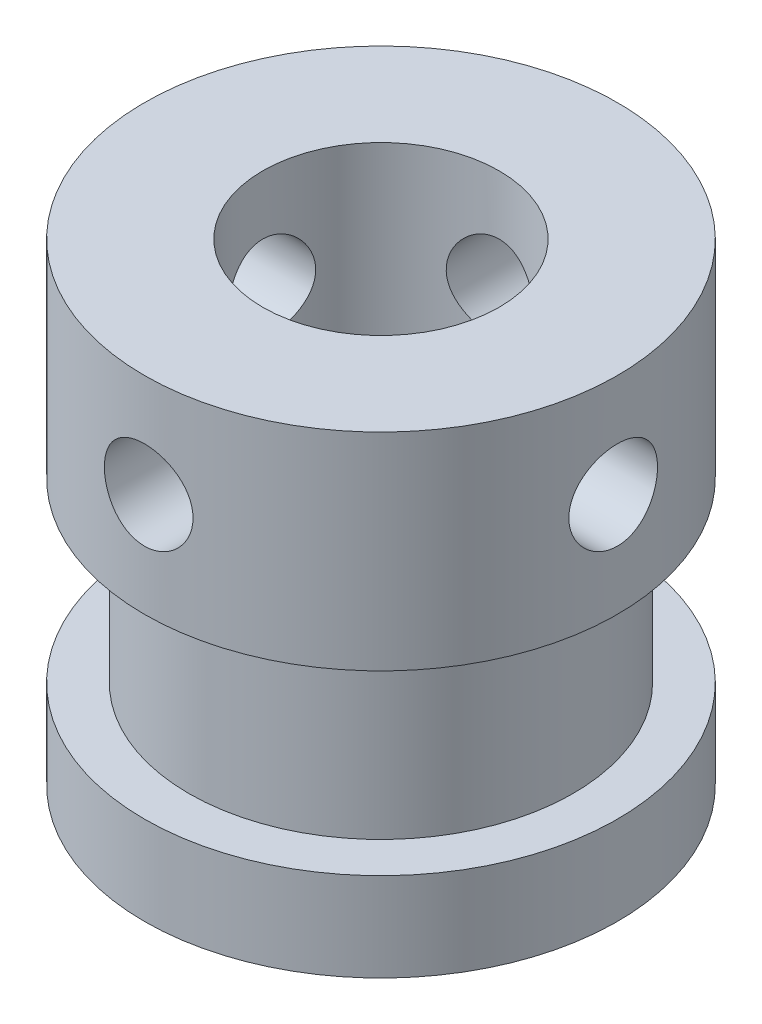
from build123d import *

# Parameters (mm, degrees)
SKETCH_1_R               = 8
EXTRUDE_1_DEPTH          = 16
SKETCH_2_R               = 4
CUT_EXTRUDE_1_DEPTH      = 20.595917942
SKETCH_3_OUTSIDE_W       = 23.542
SKETCH_3_OUTSIDE_H       = 23.542
SKETCH_3_OUTSIDE_R       = 6.5
CUT_EXTRUDE_2_DEPTH      = 6
CUT_EXTRUDE_3_DEPTH      = 20.595917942
CUT_EXTRUDE_3_DEPTH_BACK = 20.595917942
SKETCH_4_R               = 1.5
CUT_EXTRUDE_4_DEPTH      = 20.595918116
CUT_EXTRUDE_4_DEPTH_BACK = 20.595918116
SKETCH_5_R               = 1.5


with BuildPart() as part:
    # Sketch 1 → Extrude 1 (new body)
    with BuildSketch(Plane(origin=(0, 0, 0), x_dir=(1, 0, 0), z_dir=(0, 1, 0))):
        with Locations(Location((0, 0, 0), (0, 0, 270))):
            Circle(SKETCH_1_R)
    extrude(amount=EXTRUDE_1_DEPTH)

    # Sketch 2 → Cut-Extrude 1 (cut, through all)
    with BuildSketch(Plane(origin=(0, 16, 0), x_dir=(1, 0, 0), z_dir=(0, 1, 0))):
        with Locations(Location((0, 0, 0), (0, 0, 270))):
            Circle(SKETCH_2_R)
    extrude(amount=-CUT_EXTRUDE_1_DEPTH, mode=Mode.SUBTRACT)

    # Sketch 3 outside → Cut-Extrude 2 (cut)
    with BuildSketch(Plane(origin=(0, 3, 0), x_dir=(1, 0, 0), z_dir=(0, 1, 0))):
        Rectangle(SKETCH_3_OUTSIDE_W, SKETCH_3_OUTSIDE_H)
        with Locations(Location((0, 0, 0), (0, 0, 270))):
            Circle(SKETCH_3_OUTSIDE_R, mode=Mode.SUBTRACT)
    extrude(amount=CUT_EXTRUDE_2_DEPTH, mode=Mode.SUBTRACT)

    # Sketch 4 → Cut-Extrude 3 (cut, two sides: drawn at the far end of the back side and taken through both)
    with BuildSketch(Plane(origin=(0, 0, 0), x_dir=(0, 0, -1), z_dir=(1, 0, 0)).offset(-CUT_EXTRUDE_3_DEPTH_BACK)):
        with Locations((0, 12.5)):
            Circle(SKETCH_4_R)
    extrude(amount=CUT_EXTRUDE_3_DEPTH + CUT_EXTRUDE_3_DEPTH_BACK, mode=Mode.SUBTRACT)

    # Sketch 5 → Cut-Extrude 4 (cut, two sides: drawn at the far end of the back side and taken through both)
    with BuildSketch(Plane.XY.offset(-CUT_EXTRUDE_4_DEPTH_BACK)):
        with Locations((0, 12.5)):
            Circle(SKETCH_5_R)
    extrude(amount=CUT_EXTRUDE_4_DEPTH + CUT_EXTRUDE_4_DEPTH_BACK, mode=Mode.SUBTRACT)


solid = part.part
